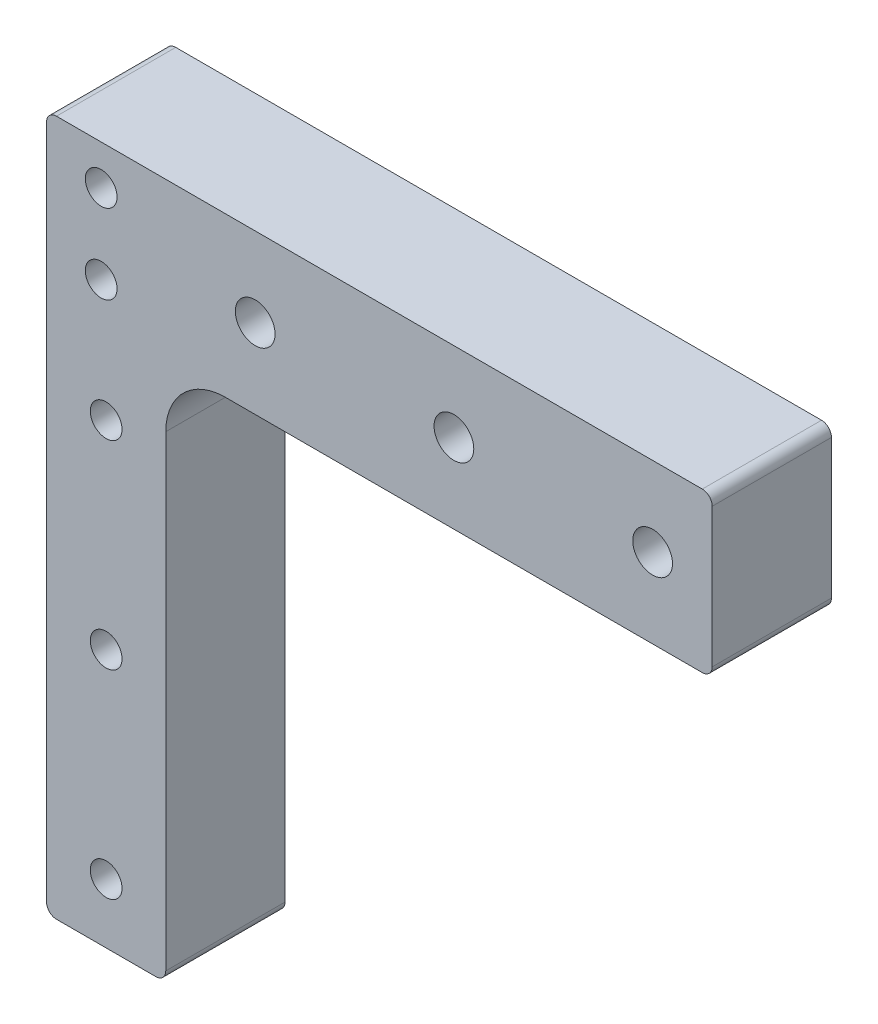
from build123d import *

# Parameters (mm, degrees)
SKETCH_1_R          = 1.6
EXTRUDE_1_DEPTH     = 12
FILLET_1_R          = 6
FILLET_2_R          = 1
SKETCH_3_R          = 2
CUT_EXTRUDE_2_DEPTH = 5
CUT_EXTRUDE_START   = -5
SKETCH_4_R          = 2
CUT_EXTRUDE_3_DEPTH = 5


with BuildPart() as part:
    # Sketch 1 → Extrude 1 (new body)
    with BuildSketch(Plane.XY):
        Polygon((46, 8), (-21, 8), (-21, -62), (-9, -62), (-9, -8), (46, -8), align=None)
        Circle(SKETCH_1_R, mode=Mode.SUBTRACT)
        with Locations((20, 0)):
            Circle(SKETCH_1_R, mode=Mode.SUBTRACT)
        with Locations((40, 0)):
            Circle(SKETCH_1_R, mode=Mode.SUBTRACT)
        with Locations((-15.5, -4)):
            Circle(SKETCH_1_R, mode=Mode.SUBTRACT)
        with Locations((-15.5, 4)):
            Circle(SKETCH_1_R, mode=Mode.SUBTRACT)
        with Locations((-15, -56)):
            Circle(SKETCH_1_R, mode=Mode.SUBTRACT)
        with Locations((-15, -36)):
            Circle(SKETCH_1_R, mode=Mode.SUBTRACT)
        with Locations((-15, -16)):
            Circle(SKETCH_1_R, mode=Mode.SUBTRACT)
    extrude(amount=EXTRUDE_1_DEPTH)

    # Fillet 1
    fillet_1_edges = [part.edges().sort_by_distance(p)[0] for p in [
        (-9, -8, 6),
    ]]
    fillet(fillet_1_edges, radius=FILLET_1_R)

    # Fillet 2
    fillet_2_edges = [part.edges().sort_by_distance(p)[0] for p in [
        (46, -8, 6),
        (-9, -62, 6),
        (-21, -62, 6),
        (-21, 8, 6),
        (46, 8, 6),
    ]]
    fillet(fillet_2_edges, radius=FILLET_2_R)

    # Sketch 3 → Cut-Extrude 2 (cut)
    with BuildSketch(Plane.XY.offset(12)):
        Circle(SKETCH_3_R)
        with Locations((20, 0)):
            Circle(SKETCH_3_R)
        with Locations((40, 0)):
            Circle(SKETCH_3_R)
    extrude(amount=-CUT_EXTRUDE_2_DEPTH, mode=Mode.SUBTRACT)

    # Sketch 4 → Cut-Extrude 3 (cut)
    with BuildSketch(Plane(origin=(0, 0, 0), x_dir=(-1, 0, 0), z_dir=(0, 0, -1)).offset(CUT_EXTRUDE_START)):
        with Locations(Location((0, 0, 0), (0, 0, 180))):
            Circle(SKETCH_4_R)
        with Locations(Location((-20, 0, 0), (0, 0, 180))):
            Circle(SKETCH_4_R)
        with Locations(Location((-40, 0, 0), (0, 0, 180))):
            Circle(SKETCH_4_R)
    extrude(amount=CUT_EXTRUDE_3_DEPTH, mode=Mode.SUBTRACT)


solid = part.part
